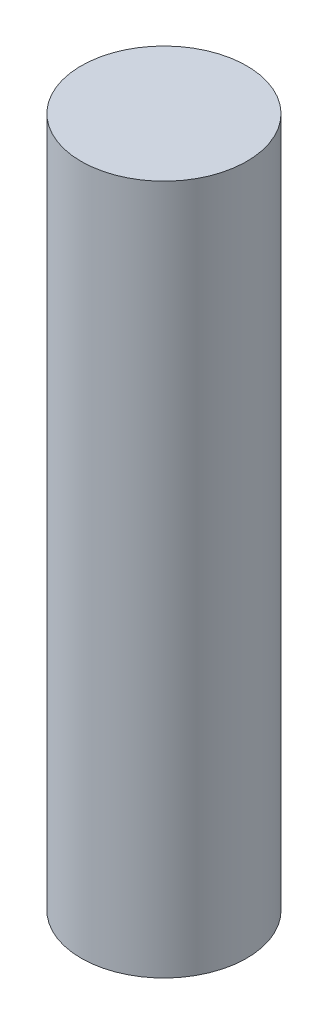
from build123d import *

# Parameters (mm, degrees)
SKETCH1_R           = 1.5
BOSS_EXTRUDE1_DEPTH = 12.5


with BuildPart() as part:
    # Sketch1 → Boss-Extrude1 (new body)
    with BuildSketch(Plane(origin=(0, 0, 0), x_dir=(1, 0, 0), z_dir=(0, 1, 0))):
        with Locations(Location((0, 0, 0), (0, 0, 270))):
            Circle(SKETCH1_R)
    extrude(amount=BOSS_EXTRUDE1_DEPTH)


solid = part.part
